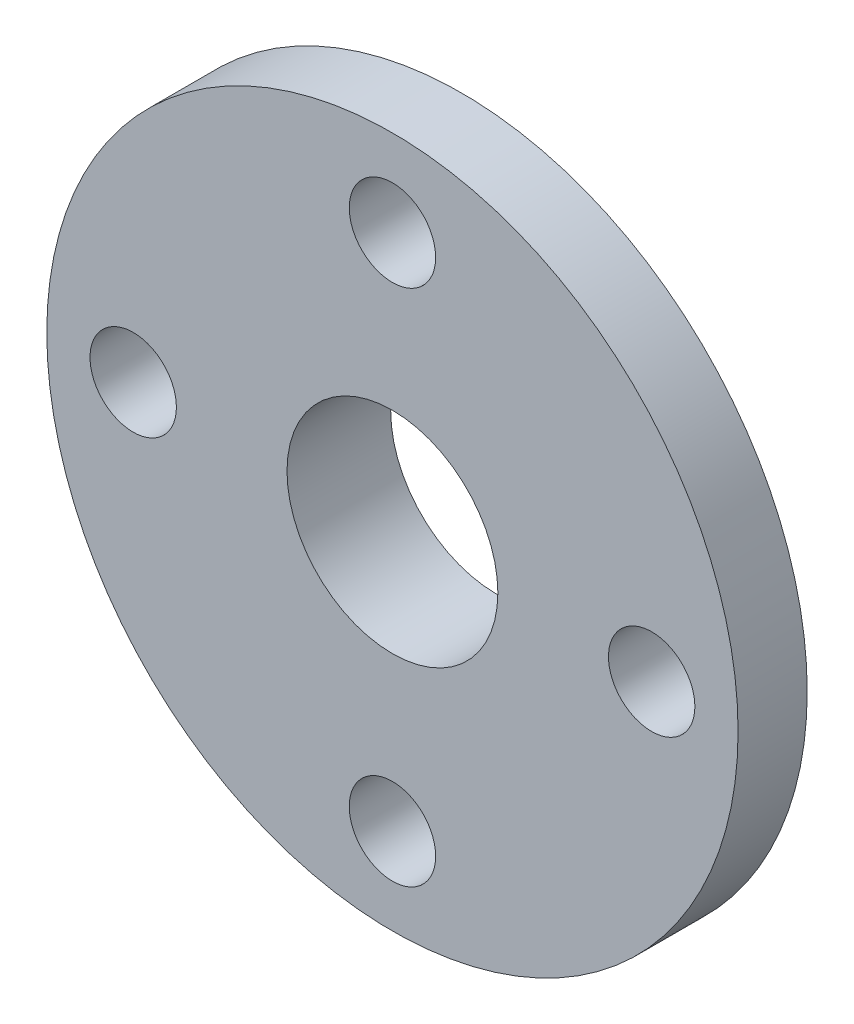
from build123d import *

# Parameters (mm, degrees)
ESQUISSE1_R             = 10
ESQUISSE1_R_2           = 1.25
BOSS_EXTRU_1_DEPTH      = 2
ESQUISSE2_R             = 4.5
BOSS_EXTRU_2_DEPTH      = 1
ESQUISSE3_R             = 3.05
ENL_V_MAT_EXTRU_1_DEPTH = 15.456832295


with BuildPart() as part:
    # Esquisse1 → Boss.-Extru.1 (new body)
    with BuildSketch(Plane.XY):
        Circle(ESQUISSE1_R)
        with Locations((-7.5, 0)):
            Circle(ESQUISSE1_R_2, mode=Mode.SUBTRACT)
        with Locations((0, 7.5)):
            Circle(ESQUISSE1_R_2, mode=Mode.SUBTRACT)
        with Locations((7.5, 0)):
            Circle(ESQUISSE1_R_2, mode=Mode.SUBTRACT)
        with Locations((0, -7.5)):
            Circle(ESQUISSE1_R_2, mode=Mode.SUBTRACT)
    extrude(amount=BOSS_EXTRU_1_DEPTH)

    # Esquisse2 → Boss.-Extru.2 (add)
    with BuildSketch(Plane(origin=(0, 0, 0), x_dir=(-1, 0, 0), z_dir=(0, 0, -1))):
        with Locations(Location((0, 0, 0), (0, 0, 180))):
            Circle(ESQUISSE2_R)
    extrude(amount=BOSS_EXTRU_2_DEPTH)

    # Esquisse3 → Enl_v. mat.-Extru.1 (cut, through all)
    with BuildSketch(Plane.XY.offset(2)):
        Circle(ESQUISSE3_R)
    extrude(amount=-ENL_V_MAT_EXTRU_1_DEPTH, mode=Mode.SUBTRACT)


solid = part.part
